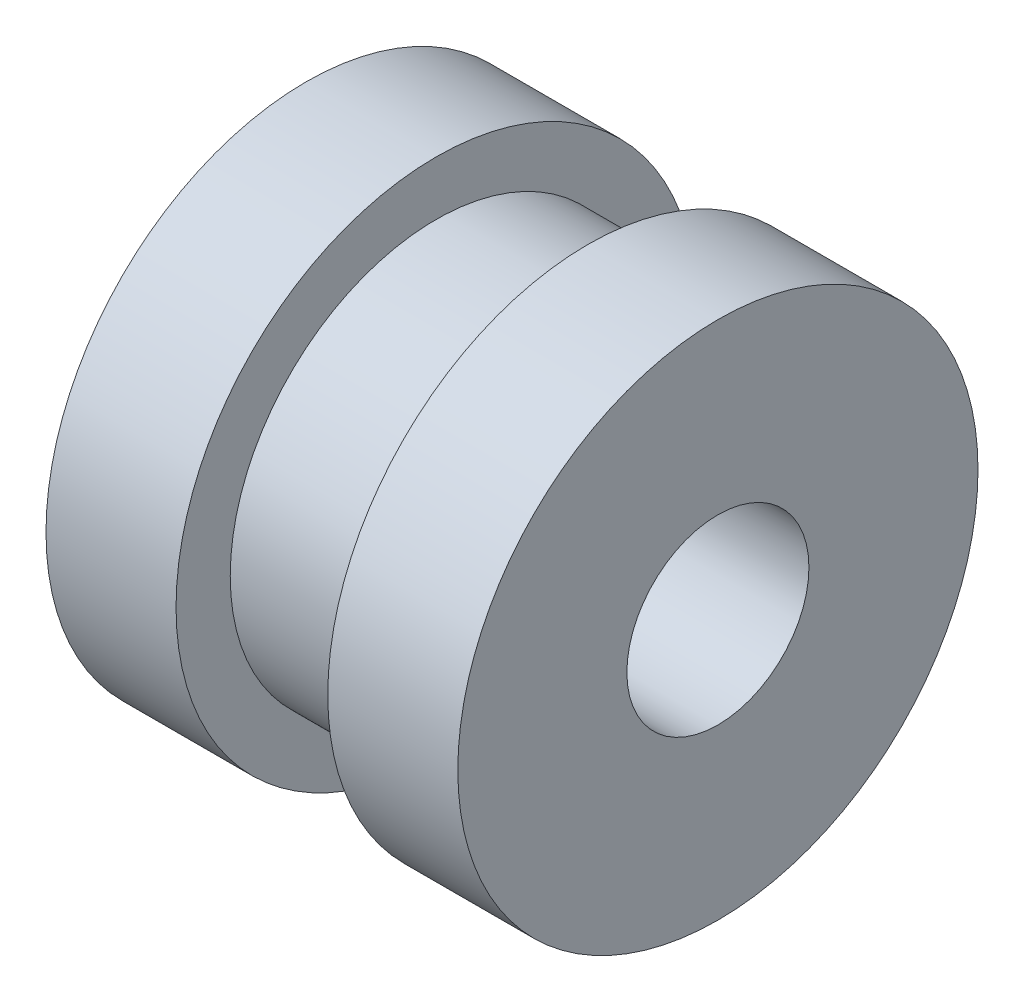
ISO-10303-21;
HEADER;
FILE_DESCRIPTION(('STEP AP214'),'2;1');
FILE_NAME('part.step','',(''),(''),'','','');
FILE_SCHEMA(('AUTOMOTIVE_DESIGN { 1 0 10303 214 1 1 1 1 }'));
ENDSEC;
DATA;
#1=APPLICATION_CONTEXT('core data for automotive mechanical design processes');
#2=APPLICATION_PROTOCOL_DEFINITION('international standard','automotive_design',2000,#1);
#3=PRODUCT_CONTEXT('',#1,'mechanical');
#4=PRODUCT('Part','Part','',(#3));
#5=PRODUCT_RELATED_PRODUCT_CATEGORY('part','',(#4));
#6=PRODUCT_DEFINITION_FORMATION('','',#4);
#7=PRODUCT_DEFINITION_CONTEXT('part definition',#1,'design');
#8=PRODUCT_DEFINITION('design','',#6,#7);
#9=PRODUCT_DEFINITION_SHAPE('','',#8);
#10=(LENGTH_UNIT() NAMED_UNIT(*) SI_UNIT(.MILLI.,.METRE.));
#11=(NAMED_UNIT(*) PLANE_ANGLE_UNIT() SI_UNIT($,.RADIAN.));
#12=(NAMED_UNIT(*) SI_UNIT($,.STERADIAN.) SOLID_ANGLE_UNIT());
#13=UNCERTAINTY_MEASURE_WITH_UNIT(LENGTH_MEASURE(1.E-05),#10,'distance_accuracy_value','');
#14=(GEOMETRIC_REPRESENTATION_CONTEXT(3) GLOBAL_UNCERTAINTY_ASSIGNED_CONTEXT((#13)) GLOBAL_UNIT_ASSIGNED_CONTEXT((#10,
#11,#12)) REPRESENTATION_CONTEXT('',''));
#15=CARTESIAN_POINT('',(0.,0.,0.));
#16=DIRECTION('',(0.,0.,1.));
#17=DIRECTION('',(1.,0.,0.));
#18=AXIS2_PLACEMENT_3D('',#15,#16,#17);
#19=CARTESIAN_POINT('',(0.,0.,0.));
#20=DIRECTION('',(1.,0.,0.));
#21=DIRECTION('',(0.,0.,-1.));
#22=AXIS2_PLACEMENT_3D('',#19,#20,#21);
#23=PLANE('',#22);
#24=CARTESIAN_POINT('',(0.,0.,0.));
#25=DIRECTION('',(1.,0.,0.));
#26=DIRECTION('',(0.,0.,-1.));
#27=AXIS2_PLACEMENT_3D('',#24,#25,#26);
#28=CIRCLE('',#27,2.1);
#29=CARTESIAN_POINT('',(0.,0.,-2.1));
#30=VERTEX_POINT('',#29);
#31=EDGE_CURVE('E66',#30,#30,#28,.T.);
#32=ORIENTED_EDGE('',*,*,#31,.T.);
#33=EDGE_LOOP('',(#32));
#34=FACE_BOUND('',#33,.T.);
#35=CARTESIAN_POINT('',(0.,0.,0.));
#36=DIRECTION('',(-1.,0.,0.));
#37=DIRECTION('',(0.,0.,1.));
#38=AXIS2_PLACEMENT_3D('',#35,#36,#37);
#39=CIRCLE('',#38,6.);
#40=CARTESIAN_POINT('',(0.,0.,6.));
#41=VERTEX_POINT('',#40);
#42=EDGE_CURVE('E12',#41,#41,#39,.T.);
#43=ORIENTED_EDGE('',*,*,#42,.T.);
#44=EDGE_LOOP('',(#43));
#45=FACE_BOUND('',#44,.T.);
#46=ADVANCED_FACE('F41',(#34,#45),#23,.F.);
#47=CARTESIAN_POINT('',(0.,0.,0.));
#48=DIRECTION('',(-1.,0.,0.));
#49=DIRECTION('',(0.,0.,1.));
#50=AXIS2_PLACEMENT_3D('',#47,#48,#49);
#51=CYLINDRICAL_SURFACE('',#50,6.);
#52=ORIENTED_EDGE('',*,*,#42,.F.);
#53=EDGE_LOOP('',(#52));
#54=FACE_BOUND('',#53,.T.);
#55=CARTESIAN_POINT('',(3.,0.,0.));
#56=DIRECTION('',(-1.,0.,0.));
#57=DIRECTION('',(0.,0.,1.));
#58=AXIS2_PLACEMENT_3D('',#55,#56,#57);
#59=CIRCLE('',#58,6.);
#60=CARTESIAN_POINT('',(3.,0.,6.));
#61=VERTEX_POINT('',#60);
#62=EDGE_CURVE('E47',#61,#61,#59,.T.);
#63=ORIENTED_EDGE('',*,*,#62,.T.);
#64=EDGE_LOOP('',(#63));
#65=FACE_BOUND('',#64,.T.);
#66=ADVANCED_FACE('F94',(#54,#65),#51,.T.);
#67=CARTESIAN_POINT('',(3.,0.,-4.75));
#68=DIRECTION('',(-1.,0.,0.));
#69=DIRECTION('',(0.,0.,1.));
#70=AXIS2_PLACEMENT_3D('',#67,#68,#69);
#71=PLANE('',#70);
#72=ORIENTED_EDGE('',*,*,#62,.F.);
#73=EDGE_LOOP('',(#72));
#74=FACE_BOUND('',#73,.T.);
#75=CARTESIAN_POINT('',(3.,0.,0.));
#76=DIRECTION('',(-1.,0.,0.));
#77=DIRECTION('',(0.,0.,1.));
#78=AXIS2_PLACEMENT_3D('',#75,#76,#77);
#79=CIRCLE('',#78,4.75);
#80=CARTESIAN_POINT('',(3.,0.,4.75));
#81=VERTEX_POINT('',#80);
#82=EDGE_CURVE('E51',#81,#81,#79,.T.);
#83=ORIENTED_EDGE('',*,*,#82,.T.);
#84=EDGE_LOOP('',(#83));
#85=FACE_BOUND('',#84,.T.);
#86=ADVANCED_FACE('F99',(#74,#85),#71,.F.);
#87=CARTESIAN_POINT('',(0.,0.,0.));
#88=DIRECTION('',(-1.,0.,0.));
#89=DIRECTION('',(0.,0.,1.));
#90=AXIS2_PLACEMENT_3D('',#87,#88,#89);
#91=CYLINDRICAL_SURFACE('',#90,4.75);
#92=ORIENTED_EDGE('',*,*,#82,.F.);
#93=EDGE_LOOP('',(#92));
#94=FACE_BOUND('',#93,.T.);
#95=CARTESIAN_POINT('',(6.5,0.,0.));
#96=DIRECTION('',(-1.,0.,0.));
#97=DIRECTION('',(0.,0.,1.));
#98=AXIS2_PLACEMENT_3D('',#95,#96,#97);
#99=CIRCLE('',#98,4.75);
#100=CARTESIAN_POINT('',(6.5,0.,4.75));
#101=VERTEX_POINT('',#100);
#102=EDGE_CURVE('E55',#101,#101,#99,.T.);
#103=ORIENTED_EDGE('',*,*,#102,.T.);
#104=EDGE_LOOP('',(#103));
#105=FACE_BOUND('',#104,.T.);
#106=ADVANCED_FACE('F89',(#94,#105),#91,.T.);
#107=CARTESIAN_POINT('',(6.5,0.,-4.75));
#108=DIRECTION('',(1.,0.,0.));
#109=DIRECTION('',(0.,0.,-1.));
#110=AXIS2_PLACEMENT_3D('',#107,#108,#109);
#111=PLANE('',#110);
#112=ORIENTED_EDGE('',*,*,#102,.F.);
#113=EDGE_LOOP('',(#112));
#114=FACE_BOUND('',#113,.T.);
#115=CARTESIAN_POINT('',(6.5,0.,0.));
#116=DIRECTION('',(-1.,0.,0.));
#117=DIRECTION('',(0.,0.,1.));
#118=AXIS2_PLACEMENT_3D('',#115,#116,#117);
#119=CIRCLE('',#118,6.);
#120=CARTESIAN_POINT('',(6.5,0.,6.));
#121=VERTEX_POINT('',#120);
#122=EDGE_CURVE('E60',#121,#121,#119,.T.);
#123=ORIENTED_EDGE('',*,*,#122,.T.);
#124=EDGE_LOOP('',(#123));
#125=FACE_BOUND('',#124,.T.);
#126=ADVANCED_FACE('F83',(#114,#125),#111,.F.);
#127=CARTESIAN_POINT('',(0.,0.,0.));
#128=DIRECTION('',(-1.,0.,0.));
#129=DIRECTION('',(0.,0.,1.));
#130=AXIS2_PLACEMENT_3D('',#127,#128,#129);
#131=CYLINDRICAL_SURFACE('',#130,6.);
#132=ORIENTED_EDGE('',*,*,#122,.F.);
#133=EDGE_LOOP('',(#132));
#134=FACE_BOUND('',#133,.T.);
#135=CARTESIAN_POINT('',(9.5,0.,0.));
#136=DIRECTION('',(-1.,0.,0.));
#137=DIRECTION('',(0.,0.,1.));
#138=AXIS2_PLACEMENT_3D('',#135,#136,#137);
#139=CIRCLE('',#138,6.);
#140=CARTESIAN_POINT('',(9.5,0.,6.));
#141=VERTEX_POINT('',#140);
#142=EDGE_CURVE('E63',#141,#141,#139,.T.);
#143=ORIENTED_EDGE('',*,*,#142,.T.);
#144=EDGE_LOOP('',(#143));
#145=FACE_BOUND('',#144,.T.);
#146=ADVANCED_FACE('F78',(#134,#145),#131,.T.);
#147=CARTESIAN_POINT('',(9.5,0.,0.));
#148=DIRECTION('',(-1.,0.,0.));
#149=DIRECTION('',(0.,0.,1.));
#150=AXIS2_PLACEMENT_3D('',#147,#148,#149);
#151=PLANE('',#150);
#152=CARTESIAN_POINT('',(9.5,0.,0.));
#153=DIRECTION('',(1.,0.,0.));
#154=DIRECTION('',(0.,0.,-1.));
#155=AXIS2_PLACEMENT_3D('',#152,#153,#154);
#156=CIRCLE('',#155,2.09999999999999);
#157=CARTESIAN_POINT('',(9.5,0.,-2.09999999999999));
#158=VERTEX_POINT('',#157);
#159=EDGE_CURVE('E69',#158,#158,#156,.T.);
#160=ORIENTED_EDGE('',*,*,#159,.F.);
#161=EDGE_LOOP('',(#160));
#162=FACE_BOUND('',#161,.T.);
#163=ORIENTED_EDGE('',*,*,#142,.F.);
#164=EDGE_LOOP('',(#163));
#165=FACE_BOUND('',#164,.T.);
#166=ADVANCED_FACE('F75',(#162,#165),#151,.F.);
#167=CARTESIAN_POINT('',(9.5,0.,0.));
#168=DIRECTION('',(1.,0.,0.));
#169=DIRECTION('',(0.,0.,-1.));
#170=AXIS2_PLACEMENT_3D('',#167,#168,#169);
#171=CYLINDRICAL_SURFACE('',#170,2.09999999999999);
#172=ORIENTED_EDGE('',*,*,#31,.F.);
#173=EDGE_LOOP('',(#172));
#174=FACE_BOUND('',#173,.T.);
#175=ORIENTED_EDGE('',*,*,#159,.T.);
#176=EDGE_LOOP('',(#175));
#177=FACE_BOUND('',#176,.T.);
#178=ADVANCED_FACE('F73',(#174,#177),#171,.F.);
#179=CLOSED_SHELL('',(#46,#66,#86,#106,#126,#146,#166,#178));
#180=MANIFOLD_SOLID_BREP('B2',#179);
#181=ADVANCED_BREP_SHAPE_REPRESENTATION('',(#18,#180),#14);
#182=SHAPE_DEFINITION_REPRESENTATION(#9,#181);
ENDSEC;
END-ISO-10303-21;
